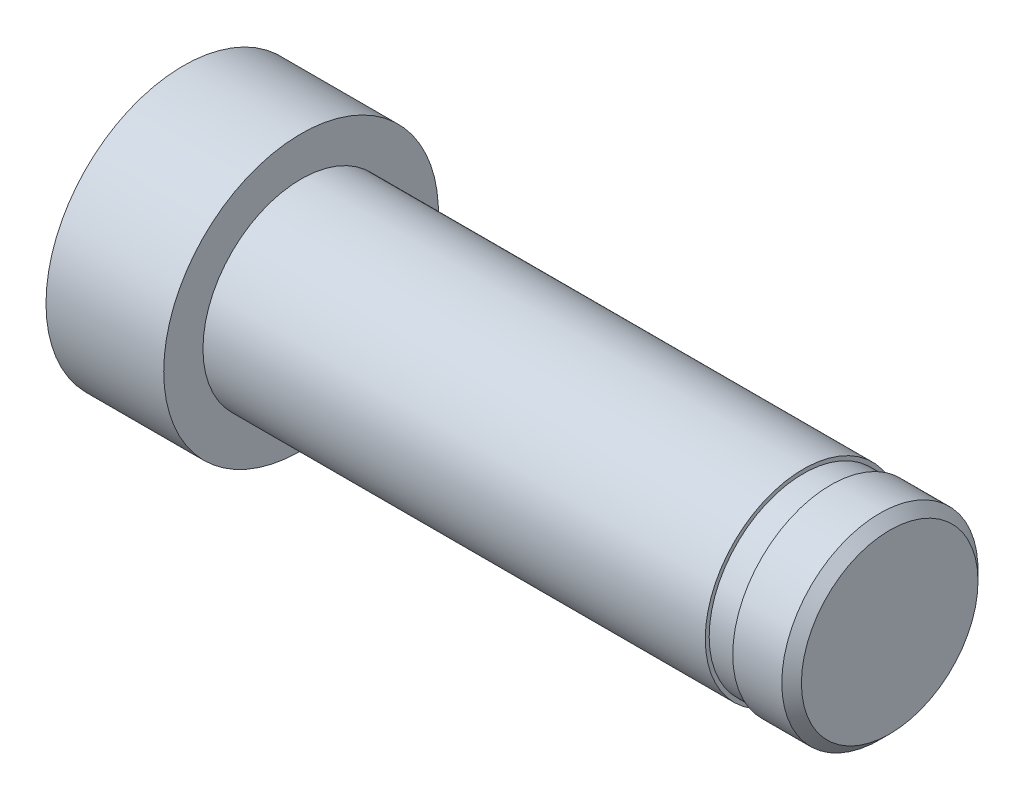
from build123d import *


with BuildPart() as part:
    # Esquisse1 → base (revolve)
    with BuildSketch(Plane.XY, mode=Mode.PRIVATE) as base_sk:
        Polygon((0, 0), (0, 3.5), (3, 3.5), (3, 2.5), (15.8, 2.5), (15.8, 2.4), (16.5, 2.4), (16.5, 2.5), (17.75, 2.5), (18, 2.25), (18, 0), align=None)
    revolve(base_sk.sketch.rotate(Axis((-4, 0, 0), (1, 0, 0)), 90), axis=Axis((-4, 0, 0), (1, 0, 0)))


solid = part.part
